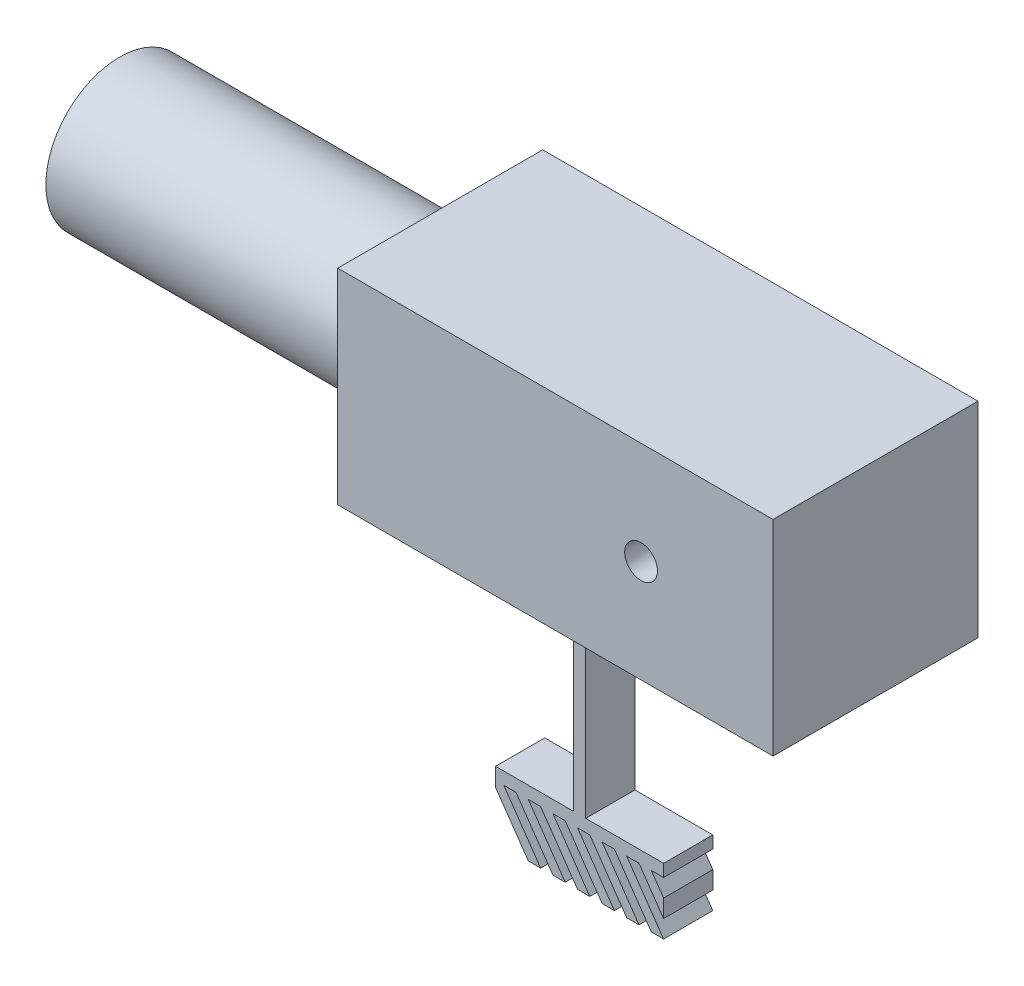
from build123d import *

# Parameters (mm, degrees)
BOSS_EXTRU_2_DEPTH      = 30
BOSS_EXTRU_2_DEPTH_BACK = 30
BOSS_EXTRU_3_DEPTH      = 331
BOSS_EXTRU_3_DEPTH_BACK = 200
ESQUISSE2_W             = 250
ESQUISSE2_H             = 250
ESQUISSE3_R             = 90.032498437
BOSS_EXTRU_4_DEPTH      = 922
ESQUISSE5_R             = 20
ENL_V_MAT_EXTRU_1_DEPTH = 107


with BuildPart() as part:
    # Esquisse1 → Boss.-Extru.2 (new, two sides: drawn at the far end of the back side and taken through both)
    with BuildSketch(Plane.XY.offset(-BOSS_EXTRU_2_DEPTH_BACK)):
        Polygon((-7.5, 0), (7.5, 0), (7.5, -400), (102.5, -400), (102.5, -415), (87.5, -415), (102.5, -436.666666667), (102.5, -458.333333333), (72.5, -415), (57.5, -415), (102.5, -480), (87.5, -480), (42.5, -415), (27.5, -415), (72.5, -480), (57.5, -480), (12.5, -415), (-2.5, -415), (42.5, -480), (27.5, -480), (-17.5, -415), (-32.5, -415), (12.5, -480), (-2.5, -480), (-47.5, -415), (-62.5, -415), (-17.5, -480), (-32.5, -480), (-77.5, -415), (-92.5, -415), (-47.5, -480), (-62.5, -480), (-102.5, -422.222222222), (-102.5, -400), (-7.5, -400), align=None)
    extrude(amount=BOSS_EXTRU_2_DEPTH + BOSS_EXTRU_2_DEPTH_BACK)

    # Esquisse2 → Boss.-Extru.3 (add, two sides: drawn at the far end of the back side and taken through both)
    with BuildSketch(Plane(origin=(0, 0, 0), x_dir=(0, 0, -1), z_dir=(1, 0, 0)).offset(-BOSS_EXTRU_3_DEPTH_BACK)):
        Rectangle(ESQUISSE2_W, ESQUISSE2_H)
    extrude(amount=BOSS_EXTRU_3_DEPTH + BOSS_EXTRU_3_DEPTH_BACK)

    # Esquisse3 → Boss.-Extru.4 (add)
    with BuildSketch(Plane(origin=(331, 0, 0), x_dir=(0, 0, -1), z_dir=(1, 0, 0))):
        Circle(ESQUISSE3_R)
    extrude(amount=-BOSS_EXTRU_4_DEPTH)

    # Esquisse5 → Enl_v. mat.-Extru.1 (cut)
    with BuildSketch(Plane.XY.offset(125)):
        with Locations((170, 0)):
            Circle(ESQUISSE5_R)
    extrude(amount=-ENL_V_MAT_EXTRU_1_DEPTH, mode=Mode.SUBTRACT)


solid = part.part
